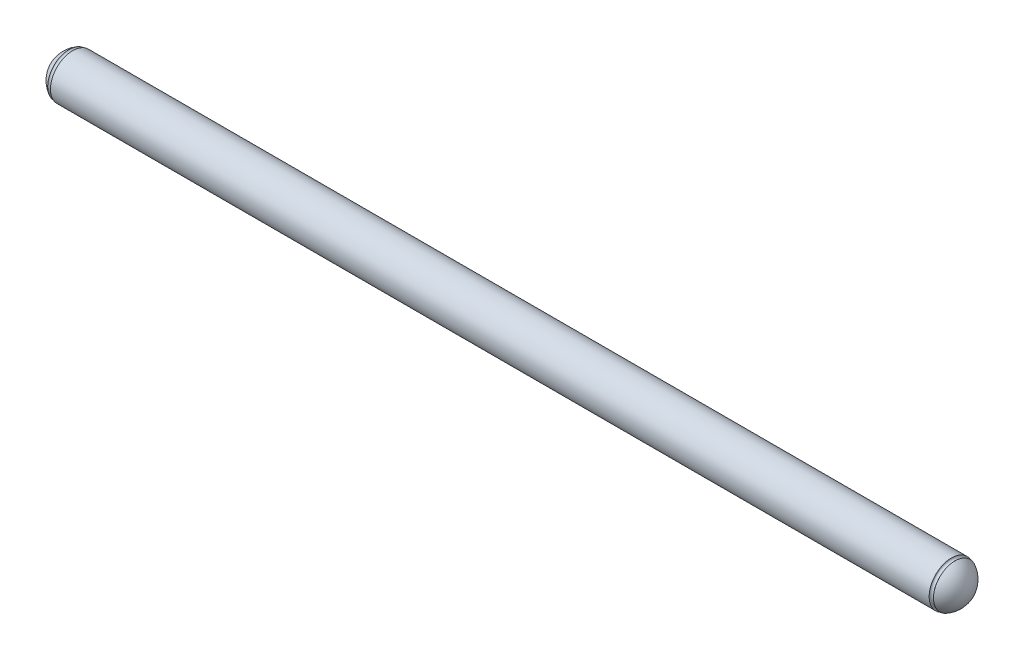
from build123d import *


with BuildPart() as part:
    # Sketch 1 → Revolve 1 (revolve)
    with BuildSketch(Plane.XY, mode=Mode.PRIVATE) as revolve_1_sk:
        with BuildLine():
            Line((-61.5, 0), (61.5, 0))
            ThreePointArc((61.5, 0), (61.02150012, 1.697435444), (59.726900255, 2.89504156))
            ThreePointArc((59.726900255, 2.89504156), (59.446264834, 2.755843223), (59.25, 3))
            Line((59.25, 3), (-59.25, 3))
            ThreePointArc((-59.25, 3), (-59.446264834, 2.755843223), (-59.726900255, 2.89504156))
            ThreePointArc((-59.726900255, 2.89504156), (-61.02150012, 1.697435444), (-61.5, 0))
        make_face()
    revolve(revolve_1_sk.sketch.rotate(Axis((-61.5, 0, 0), (1, 0, 0)), 90), axis=Axis((-61.5, 0, 0), (1, 0, 0)))


solid = part.part
